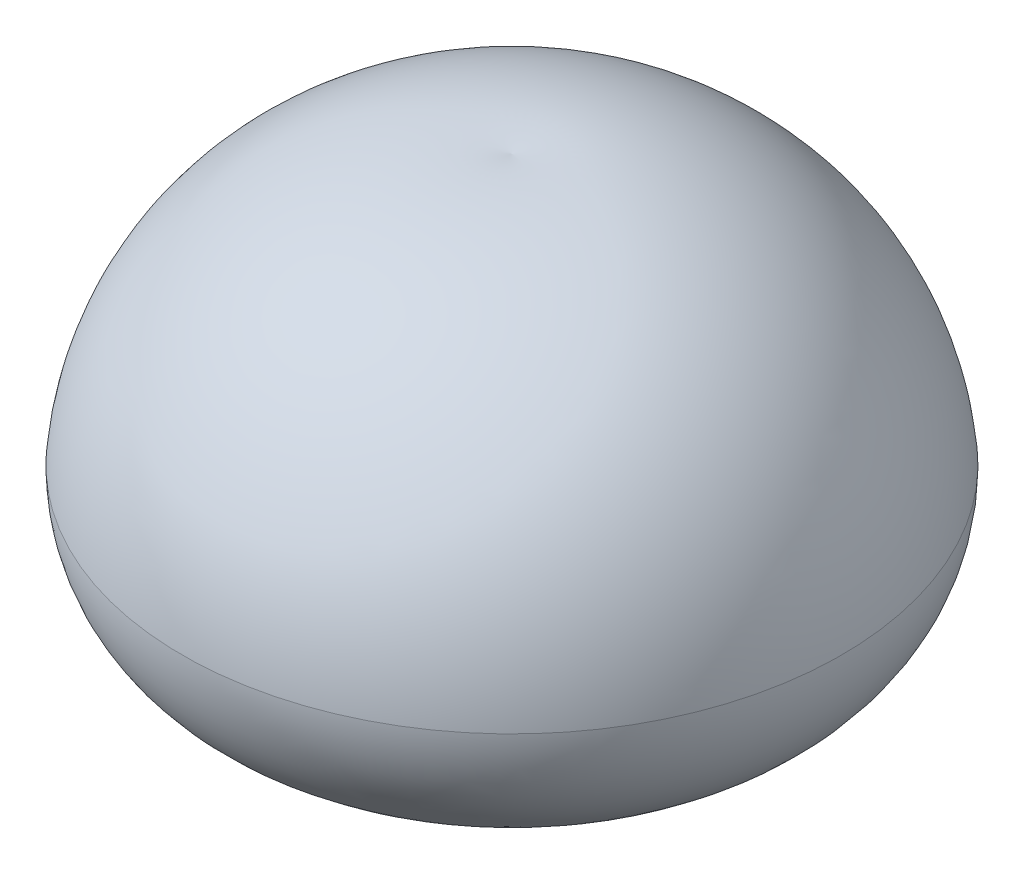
from build123d import *


with BuildPart() as part:
    # Sketch 1 → Revolve 2 (revolve)
    with BuildSketch(Plane.XY, mode=Mode.PRIVATE) as revolve_2_sk:
        with BuildLine():
            ThreePointArc((-120.756628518, 2243.522135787), (-60.20724347, 2235.931916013), (0, 2225.985695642))
            Line((0, 2225.985695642), (0, 3097.70400443))
            ThreePointArc((0, 3097.70400443), (-1820.81984501, 2566.604746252), (-2703.268003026, 887.695404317))
            ThreePointArc((-2703.268003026, 887.695404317), (-1753.605384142, -353.343518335), (-307.482383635, 238.910620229))
            ThreePointArc((-307.482383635, 238.910620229), (-714.695404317, 555.528915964), (-556.446583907, 1046.473821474))
            ThreePointArc((-556.446583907, 1046.473821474), (-497.270318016, 1702.748666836), (-120.756628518, 2243.522135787))
        make_face()
    revolve(revolve_2_sk.sketch.rotate(Axis((0, 2225.985695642, 0), (0, 1, 0)), 270), axis=Axis((0, 2225.985695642, 0), (0, 1, 0)))


solid = part.part
